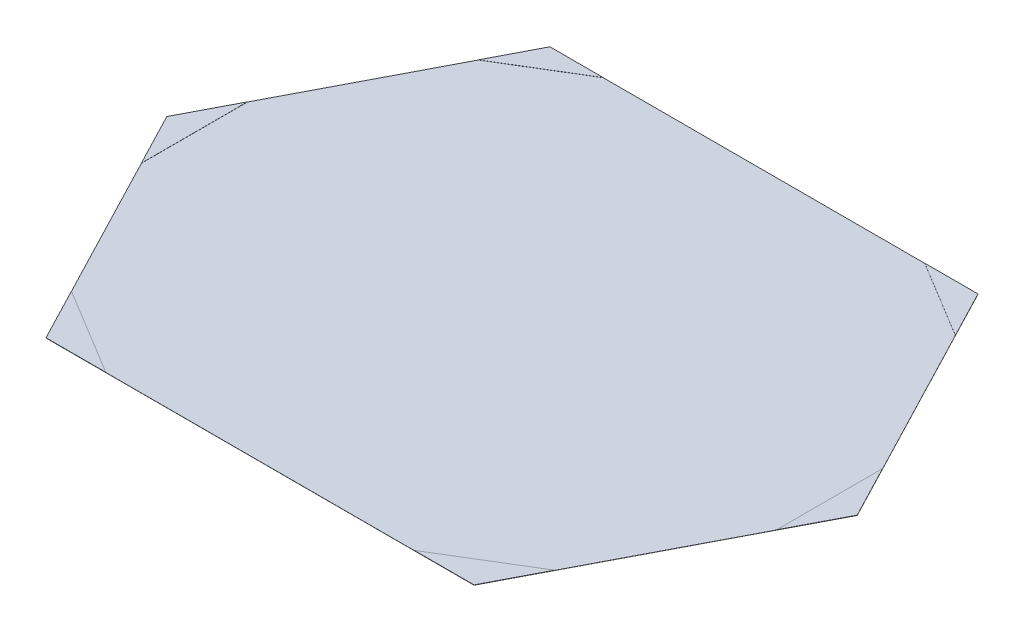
ISO-10303-21;
HEADER;
FILE_DESCRIPTION(('STEP AP214'),'2;1');
FILE_NAME('part.step','',(''),(''),'','','');
FILE_SCHEMA(('AUTOMOTIVE_DESIGN { 1 0 10303 214 1 1 1 1 }'));
ENDSEC;
DATA;
#1=APPLICATION_CONTEXT('core data for automotive mechanical design processes');
#2=APPLICATION_PROTOCOL_DEFINITION('international standard','automotive_design',2000,#1);
#3=PRODUCT_CONTEXT('',#1,'mechanical');
#4=PRODUCT('Part','Part','',(#3));
#5=PRODUCT_RELATED_PRODUCT_CATEGORY('part','',(#4));
#6=PRODUCT_DEFINITION_FORMATION('','',#4);
#7=PRODUCT_DEFINITION_CONTEXT('part definition',#1,'design');
#8=PRODUCT_DEFINITION('design','',#6,#7);
#9=PRODUCT_DEFINITION_SHAPE('','',#8);
#10=(LENGTH_UNIT() NAMED_UNIT(*) SI_UNIT(.MILLI.,.METRE.));
#11=(NAMED_UNIT(*) PLANE_ANGLE_UNIT() SI_UNIT($,.RADIAN.));
#12=(NAMED_UNIT(*) SI_UNIT($,.STERADIAN.) SOLID_ANGLE_UNIT());
#13=UNCERTAINTY_MEASURE_WITH_UNIT(LENGTH_MEASURE(1.E-05),#10,'distance_accuracy_value','');
#14=(GEOMETRIC_REPRESENTATION_CONTEXT(3) GLOBAL_UNCERTAINTY_ASSIGNED_CONTEXT((#13)) GLOBAL_UNIT_ASSIGNED_CONTEXT((#10,
#11,#12)) REPRESENTATION_CONTEXT('',''));
#15=CARTESIAN_POINT('',(0.,0.,0.));
#16=DIRECTION('',(0.,0.,1.));
#17=DIRECTION('',(1.,0.,0.));
#18=AXIS2_PLACEMENT_3D('',#15,#16,#17);
#19=CARTESIAN_POINT('',(0.,1.,0.));
#20=DIRECTION('',(0.,1.,0.));
#21=DIRECTION('',(0.,0.,1.));
#22=AXIS2_PLACEMENT_3D('',#19,#20,#21);
#23=PLANE('',#22);
#24=DIRECTION('',(0.,0.,-1.));
#25=VECTOR('',#24,1.);
#26=CARTESIAN_POINT('',(4800.,1.,384.210526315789));
#27=LINE('',#26,#25);
#28=CARTESIAN_POINT('',(4800.,1.,384.21052631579));
#29=VERTEX_POINT('',#28);
#30=CARTESIAN_POINT('',(4800.,1.,-384.210526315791));
#31=VERTEX_POINT('',#30);
#32=EDGE_CURVE('E172',#29,#31,#27,.T.);
#33=ORIENTED_EDGE('',*,*,#32,.T.);
#34=DIRECTION('',(-0.461735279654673,0.,-0.887017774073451));
#35=VECTOR('',#34,1.);
#36=CARTESIAN_POINT('',(4050.,1.,-1825.));
#37=LINE('',#36,#35);
#38=CARTESIAN_POINT('',(4228.00823517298,1.,-1483.03681137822));
#39=VERTEX_POINT('',#38);
#40=EDGE_CURVE('E59',#31,#39,#37,.T.);
#41=ORIENTED_EDGE('',*,*,#40,.T.);
#42=DIRECTION('',(-0.854907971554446,0.,-0.5187796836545));
#43=VECTOR('',#42,1.);
#44=CARTESIAN_POINT('',(4228.00823517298,1.,-1483.03681137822));
#45=LINE('',#44,#43);
#46=CARTESIAN_POINT('',(3664.47989136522,1.,-1825.));
#47=VERTEX_POINT('',#46);
#48=EDGE_CURVE('E194',#39,#47,#45,.T.);
#49=ORIENTED_EDGE('',*,*,#48,.T.);
#50=DIRECTION('',(-1.,0.,0.));
#51=VECTOR('',#50,1.);
#52=CARTESIAN_POINT('',(950.,1.,-1825.));
#53=LINE('',#52,#51);
#54=CARTESIAN_POINT('',(1335.52010863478,1.,-1825.));
#55=VERTEX_POINT('',#54);
#56=EDGE_CURVE('E169',#47,#55,#53,.T.);
#57=ORIENTED_EDGE('',*,*,#56,.T.);
#58=DIRECTION('',(0.854907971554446,0.,-0.5187796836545));
#59=VECTOR('',#58,1.);
#60=CARTESIAN_POINT('',(771.991764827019,1.,-1483.03681137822));
#61=LINE('',#60,#59);
#62=CARTESIAN_POINT('',(771.991764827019,1.,-1483.03681137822));
#63=VERTEX_POINT('',#62);
#64=EDGE_CURVE('E210',#63,#55,#61,.T.);
#65=ORIENTED_EDGE('',*,*,#64,.F.);
#66=DIRECTION('',(-0.461735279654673,0.,0.887017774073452));
#67=VECTOR('',#66,1.);
#68=CARTESIAN_POINT('',(0.,1.,0.));
#69=LINE('',#68,#67);
#70=CARTESIAN_POINT('',(200.,1.,-384.210526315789));
#71=VERTEX_POINT('',#70);
#72=EDGE_CURVE('E39',#63,#71,#69,.T.);
#73=ORIENTED_EDGE('',*,*,#72,.T.);
#74=DIRECTION('',(0.,0.,1.));
#75=VECTOR('',#74,1.);
#76=CARTESIAN_POINT('',(200.,1.,0.));
#77=LINE('',#76,#75);
#78=CARTESIAN_POINT('',(200.,1.,384.21052631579));
#79=VERTEX_POINT('',#78);
#80=EDGE_CURVE('E247',#71,#79,#77,.T.);
#81=ORIENTED_EDGE('',*,*,#80,.T.);
#82=DIRECTION('',(0.461735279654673,0.,0.887017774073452));
#83=VECTOR('',#82,1.);
#84=CARTESIAN_POINT('',(0.,1.,0.));
#85=LINE('',#84,#83);
#86=CARTESIAN_POINT('',(750.,1.,1440.78947368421));
#87=VERTEX_POINT('',#86);
#88=EDGE_CURVE('E272',#79,#87,#85,.T.);
#89=ORIENTED_EDGE('',*,*,#88,.T.);
#90=DIRECTION('',(0.854907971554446,0.,0.5187796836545));
#91=VECTOR('',#90,1.);
#92=CARTESIAN_POINT('',(-437.153665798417,1.,720.394736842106));
#93=LINE('',#92,#91);
#94=CARTESIAN_POINT('',(1383.14862175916,1.,1825.));
#95=VERTEX_POINT('',#94);
#96=EDGE_CURVE('E227',#87,#95,#93,.T.);
#97=ORIENTED_EDGE('',*,*,#96,.T.);
#98=DIRECTION('',(1.,0.,0.));
#99=VECTOR('',#98,1.);
#100=CARTESIAN_POINT('',(950.,1.,1825.));
#101=LINE('',#100,#99);
#102=CARTESIAN_POINT('',(3616.85137824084,1.,1825.));
#103=VERTEX_POINT('',#102);
#104=EDGE_CURVE('E350',#95,#103,#101,.T.);
#105=ORIENTED_EDGE('',*,*,#104,.T.);
#106=DIRECTION('',(-0.854907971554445,0.,0.518779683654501));
#107=VECTOR('',#106,1.);
#108=CARTESIAN_POINT('',(1782.81546666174,1.,2937.93917202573));
#109=LINE('',#108,#107);
#110=CARTESIAN_POINT('',(4250.,1.,1440.78947368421));
#111=VERTEX_POINT('',#110);
#112=EDGE_CURVE('E244',#111,#103,#109,.T.);
#113=ORIENTED_EDGE('',*,*,#112,.F.);
#114=DIRECTION('',(0.461735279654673,0.,-0.887017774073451));
#115=VECTOR('',#114,1.);
#116=CARTESIAN_POINT('',(4050.,1.,1825.));
#117=LINE('',#116,#115);
#118=EDGE_CURVE('E53',#111,#29,#117,.T.);
#119=ORIENTED_EDGE('',*,*,#118,.T.);
#120=EDGE_LOOP('',(#33,#41,#49,#57,#65,#73,#81,#89,#97,#105,#113,#119));
#121=FACE_BOUND('',#120,.T.);
#122=ADVANCED_FACE('F35',(#121),#23,.T.);
#123=CARTESIAN_POINT('',(0.,1.,0.));
#124=DIRECTION('',(0.887017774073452,0.,-0.461735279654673));
#125=DIRECTION('',(-0.461735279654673,0.,-0.887017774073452));
#126=AXIS2_PLACEMENT_3D('',#123,#124,#125);
#127=PLANE('',#126);
#128=DIRECTION('',(0.461735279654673,0.,0.887017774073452));
#129=VECTOR('',#128,1.);
#130=CARTESIAN_POINT('',(0.,0.,0.));
#131=LINE('',#130,#129);
#132=CARTESIAN_POINT('',(0.,0.,0.));
#133=VERTEX_POINT('',#132);
#134=CARTESIAN_POINT('',(950.,0.,1825.));
#135=VERTEX_POINT('',#134);
#136=EDGE_CURVE('E278',#133,#135,#131,.T.);
#137=ORIENTED_EDGE('',*,*,#136,.T.);
#138=DIRECTION('',(0.,-1.,0.));
#139=VECTOR('',#138,1.);
#140=CARTESIAN_POINT('',(950.,1.,1825.));
#141=LINE('',#140,#139);
#142=CARTESIAN_POINT('',(950.,2.,1825.));
#143=VERTEX_POINT('',#142);
#144=EDGE_CURVE('E11',#143,#135,#141,.T.);
#145=ORIENTED_EDGE('',*,*,#144,.F.);
#146=DIRECTION('',(0.461735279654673,0.,0.887017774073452));
#147=VECTOR('',#146,1.);
#148=CARTESIAN_POINT('',(0.,2.,0.));
#149=LINE('',#148,#147);
#150=CARTESIAN_POINT('',(750.,2.,1440.78947368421));
#151=VERTEX_POINT('',#150);
#152=EDGE_CURVE('E233',#151,#143,#149,.T.);
#153=ORIENTED_EDGE('',*,*,#152,.F.);
#154=DIRECTION('',(0.,-1.,0.));
#155=VECTOR('',#154,1.);
#156=CARTESIAN_POINT('',(750.,2.,1440.78947368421));
#157=LINE('',#156,#155);
#158=EDGE_CURVE('E213',#151,#87,#157,.T.);
#159=ORIENTED_EDGE('',*,*,#158,.T.);
#160=ORIENTED_EDGE('',*,*,#88,.F.);
#161=DIRECTION('',(0.,-1.,0.));
#162=VECTOR('',#161,1.);
#163=CARTESIAN_POINT('',(200.,2.,384.21052631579));
#164=LINE('',#163,#162);
#165=CARTESIAN_POINT('',(200.,2.,384.21052631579));
#166=VERTEX_POINT('',#165);
#167=EDGE_CURVE('E263',#166,#79,#164,.T.);
#168=ORIENTED_EDGE('',*,*,#167,.F.);
#169=DIRECTION('',(0.461735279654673,0.,0.887017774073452));
#170=VECTOR('',#169,1.);
#171=CARTESIAN_POINT('',(0.,2.,0.));
#172=LINE('',#171,#170);
#173=CARTESIAN_POINT('',(0.,2.,0.));
#174=VERTEX_POINT('',#173);
#175=EDGE_CURVE('E261',#174,#166,#172,.T.);
#176=ORIENTED_EDGE('',*,*,#175,.F.);
#177=DIRECTION('',(0.,-1.,0.));
#178=VECTOR('',#177,1.);
#179=CARTESIAN_POINT('',(0.,1.,0.));
#180=LINE('',#179,#178);
#181=EDGE_CURVE('E301',#174,#133,#180,.T.);
#182=ORIENTED_EDGE('',*,*,#181,.T.);
#183=EDGE_LOOP('',(#137,#145,#153,#159,#160,#168,#176,#182));
#184=FACE_BOUND('',#183,.T.);
#185=ADVANCED_FACE('F37',(#184),#127,.F.);
#186=CARTESIAN_POINT('',(950.,1.,1825.));
#187=DIRECTION('',(0.,0.,-1.));
#188=DIRECTION('',(-1.,0.,0.));
#189=AXIS2_PLACEMENT_3D('',#186,#187,#188);
#190=PLANE('',#189);
#191=DIRECTION('',(1.,0.,0.));
#192=VECTOR('',#191,1.);
#193=CARTESIAN_POINT('',(950.,0.,1825.));
#194=LINE('',#193,#192);
#195=CARTESIAN_POINT('',(4050.,0.,1825.));
#196=VERTEX_POINT('',#195);
#197=EDGE_CURVE('E284',#135,#196,#194,.T.);
#198=ORIENTED_EDGE('',*,*,#197,.T.);
#199=DIRECTION('',(0.,-1.,0.));
#200=VECTOR('',#199,1.);
#201=CARTESIAN_POINT('',(4050.,1.,1825.));
#202=LINE('',#201,#200);
#203=CARTESIAN_POINT('',(4050.,2.,1825.));
#204=VERTEX_POINT('',#203);
#205=EDGE_CURVE('E45',#204,#196,#202,.T.);
#206=ORIENTED_EDGE('',*,*,#205,.F.);
#207=DIRECTION('',(1.,0.,0.));
#208=VECTOR('',#207,1.);
#209=CARTESIAN_POINT('',(0.,2.,1825.));
#210=LINE('',#209,#208);
#211=CARTESIAN_POINT('',(3616.85137824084,2.,1825.));
#212=VERTEX_POINT('',#211);
#213=EDGE_CURVE('E243',#212,#204,#210,.T.);
#214=ORIENTED_EDGE('',*,*,#213,.F.);
#215=DIRECTION('',(0.,-1.,0.));
#216=VECTOR('',#215,1.);
#217=CARTESIAN_POINT('',(3616.85137824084,2.,1825.));
#218=LINE('',#217,#216);
#219=EDGE_CURVE('E240',#212,#103,#218,.T.);
#220=ORIENTED_EDGE('',*,*,#219,.T.);
#221=ORIENTED_EDGE('',*,*,#104,.F.);
#222=DIRECTION('',(0.,-1.,0.));
#223=VECTOR('',#222,1.);
#224=CARTESIAN_POINT('',(1383.14862175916,2.,1825.));
#225=LINE('',#224,#223);
#226=CARTESIAN_POINT('',(1383.14862175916,2.,1825.));
#227=VERTEX_POINT('',#226);
#228=EDGE_CURVE('E223',#227,#95,#225,.T.);
#229=ORIENTED_EDGE('',*,*,#228,.F.);
#230=DIRECTION('',(1.,0.,0.));
#231=VECTOR('',#230,1.);
#232=CARTESIAN_POINT('',(0.,2.,1825.));
#233=LINE('',#232,#231);
#234=EDGE_CURVE('E226',#143,#227,#233,.T.);
#235=ORIENTED_EDGE('',*,*,#234,.F.);
#236=ORIENTED_EDGE('',*,*,#144,.T.);
#237=EDGE_LOOP('',(#198,#206,#214,#220,#221,#229,#235,#236));
#238=FACE_BOUND('',#237,.T.);
#239=ADVANCED_FACE('F356',(#238),#190,.F.);
#240=CARTESIAN_POINT('',(4050.,1.,1825.));
#241=DIRECTION('',(-0.887017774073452,0.,-0.461735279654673));
#242=DIRECTION('',(-0.461735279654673,0.,0.887017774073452));
#243=AXIS2_PLACEMENT_3D('',#240,#241,#242);
#244=PLANE('',#243);
#245=DIRECTION('',(0.461735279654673,0.,-0.887017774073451));
#246=VECTOR('',#245,1.);
#247=CARTESIAN_POINT('',(4050.,0.,1825.));
#248=LINE('',#247,#246);
#249=CARTESIAN_POINT('',(5000.,0.,0.));
#250=VERTEX_POINT('',#249);
#251=EDGE_CURVE('E289',#196,#250,#248,.T.);
#252=ORIENTED_EDGE('',*,*,#251,.T.);
#253=DIRECTION('',(0.,-1.,0.));
#254=VECTOR('',#253,1.);
#255=CARTESIAN_POINT('',(5000.,1.,0.));
#256=LINE('',#255,#254);
#257=CARTESIAN_POINT('',(5000.,2.,-1.40491376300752E-12));
#258=VERTEX_POINT('',#257);
#259=EDGE_CURVE('E309',#258,#250,#256,.T.);
#260=ORIENTED_EDGE('',*,*,#259,.F.);
#261=DIRECTION('',(-0.461735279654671,0.,0.887017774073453));
#262=VECTOR('',#261,1.);
#263=CARTESIAN_POINT('',(5000.,2.,-1.40491376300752E-12));
#264=LINE('',#263,#262);
#265=CARTESIAN_POINT('',(4800.,2.,384.210526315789));
#266=VERTEX_POINT('',#265);
#267=EDGE_CURVE('E179',#258,#266,#264,.T.);
#268=ORIENTED_EDGE('',*,*,#267,.T.);
#269=DIRECTION('',(0.,-1.,0.));
#270=VECTOR('',#269,1.);
#271=CARTESIAN_POINT('',(4800.,2.,384.210526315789));
#272=LINE('',#271,#270);
#273=EDGE_CURVE('E180',#266,#29,#272,.T.);
#274=ORIENTED_EDGE('',*,*,#273,.T.);
#275=ORIENTED_EDGE('',*,*,#118,.F.);
#276=DIRECTION('',(0.,-1.,0.));
#277=VECTOR('',#276,1.);
#278=CARTESIAN_POINT('',(4250.,2.,1440.78947368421));
#279=LINE('',#278,#277);
#280=CARTESIAN_POINT('',(4250.,2.,1440.78947368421));
#281=VERTEX_POINT('',#280);
#282=EDGE_CURVE('E230',#281,#111,#279,.T.);
#283=ORIENTED_EDGE('',*,*,#282,.F.);
#284=DIRECTION('',(0.461735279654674,0.,-0.887017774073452));
#285=VECTOR('',#284,1.);
#286=CARTESIAN_POINT('',(3934.0026576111,2.,2047.83699985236));
#287=LINE('',#286,#285);
#288=EDGE_CURVE('E248',#204,#281,#287,.T.);
#289=ORIENTED_EDGE('',*,*,#288,.F.);
#290=ORIENTED_EDGE('',*,*,#205,.T.);
#291=EDGE_LOOP('',(#252,#260,#268,#274,#275,#283,#289,#290));
#292=FACE_BOUND('',#291,.T.);
#293=ADVANCED_FACE('F316',(#292),#244,.F.);
#294=CARTESIAN_POINT('',(4050.,1.,-1825.));
#295=DIRECTION('',(-0.887017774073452,0.,0.461735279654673));
#296=DIRECTION('',(0.461735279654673,0.,0.887017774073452));
#297=AXIS2_PLACEMENT_3D('',#294,#295,#296);
#298=PLANE('',#297);
#299=DIRECTION('',(-0.461735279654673,0.,-0.887017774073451));
#300=VECTOR('',#299,1.);
#301=CARTESIAN_POINT('',(4050.,0.,-1825.));
#302=LINE('',#301,#300);
#303=CARTESIAN_POINT('',(4050.,0.,-1825.));
#304=VERTEX_POINT('',#303);
#305=EDGE_CURVE('E295',#250,#304,#302,.T.);
#306=ORIENTED_EDGE('',*,*,#305,.T.);
#307=DIRECTION('',(0.,-1.,0.));
#308=VECTOR('',#307,1.);
#309=CARTESIAN_POINT('',(4050.,1.,-1825.));
#310=LINE('',#309,#308);
#311=CARTESIAN_POINT('',(4050.,2.,-1825.));
#312=VERTEX_POINT('',#311);
#313=EDGE_CURVE('E306',#312,#304,#310,.T.);
#314=ORIENTED_EDGE('',*,*,#313,.F.);
#315=DIRECTION('',(0.461735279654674,0.,0.887017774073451));
#316=VECTOR('',#315,1.);
#317=CARTESIAN_POINT('',(4050.,2.,-1825.));
#318=LINE('',#317,#316);
#319=CARTESIAN_POINT('',(4228.00823517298,2.,-1483.03681137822));
#320=VERTEX_POINT('',#319);
#321=EDGE_CURVE('E192',#312,#320,#318,.T.);
#322=ORIENTED_EDGE('',*,*,#321,.T.);
#323=DIRECTION('',(0.,-1.,0.));
#324=VECTOR('',#323,1.);
#325=CARTESIAN_POINT('',(4228.00823517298,2.,-1483.03681137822));
#326=LINE('',#325,#324);
#327=EDGE_CURVE('E167',#320,#39,#326,.T.);
#328=ORIENTED_EDGE('',*,*,#327,.T.);
#329=ORIENTED_EDGE('',*,*,#40,.F.);
#330=DIRECTION('',(0.,-1.,0.));
#331=VECTOR('',#330,1.);
#332=CARTESIAN_POINT('',(4800.,2.,-384.210526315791));
#333=LINE('',#332,#331);
#334=CARTESIAN_POINT('',(4800.,2.,-384.210526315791));
#335=VERTEX_POINT('',#334);
#336=EDGE_CURVE('E164',#335,#31,#333,.T.);
#337=ORIENTED_EDGE('',*,*,#336,.F.);
#338=DIRECTION('',(0.461735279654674,0.,0.887017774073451));
#339=VECTOR('',#338,1.);
#340=CARTESIAN_POINT('',(4800.,2.,-384.210526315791));
#341=LINE('',#340,#339);
#342=EDGE_CURVE('E183',#335,#258,#341,.T.);
#343=ORIENTED_EDGE('',*,*,#342,.T.);
#344=ORIENTED_EDGE('',*,*,#259,.T.);
#345=EDGE_LOOP('',(#306,#314,#322,#328,#329,#337,#343,#344));
#346=FACE_BOUND('',#345,.T.);
#347=ADVANCED_FACE('F161',(#346),#298,.F.);
#348=CARTESIAN_POINT('',(950.,1.,-1825.));
#349=DIRECTION('',(0.,0.,1.));
#350=DIRECTION('',(1.,0.,0.));
#351=AXIS2_PLACEMENT_3D('',#348,#349,#350);
#352=PLANE('',#351);
#353=DIRECTION('',(-1.,0.,0.));
#354=VECTOR('',#353,1.);
#355=CARTESIAN_POINT('',(950.,0.,-1825.));
#356=LINE('',#355,#354);
#357=CARTESIAN_POINT('',(950.,0.,-1825.));
#358=VERTEX_POINT('',#357);
#359=EDGE_CURVE('E297',#304,#358,#356,.T.);
#360=ORIENTED_EDGE('',*,*,#359,.T.);
#361=DIRECTION('',(0.,-1.,0.));
#362=VECTOR('',#361,1.);
#363=CARTESIAN_POINT('',(950.,1.,-1825.));
#364=LINE('',#363,#362);
#365=CARTESIAN_POINT('',(950.,2.,-1825.));
#366=VERTEX_POINT('',#365);
#367=EDGE_CURVE('E303',#366,#358,#364,.T.);
#368=ORIENTED_EDGE('',*,*,#367,.F.);
#369=DIRECTION('',(-1.,0.,0.));
#370=VECTOR('',#369,1.);
#371=CARTESIAN_POINT('',(1335.52010863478,2.,-1825.));
#372=LINE('',#371,#370);
#373=CARTESIAN_POINT('',(1335.52010863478,2.,-1825.));
#374=VERTEX_POINT('',#373);
#375=EDGE_CURVE('E209',#374,#366,#372,.T.);
#376=ORIENTED_EDGE('',*,*,#375,.F.);
#377=DIRECTION('',(0.,-1.,0.));
#378=VECTOR('',#377,1.);
#379=CARTESIAN_POINT('',(1335.52010863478,2.,-1825.));
#380=LINE('',#379,#378);
#381=EDGE_CURVE('E206',#374,#55,#380,.T.);
#382=ORIENTED_EDGE('',*,*,#381,.T.);
#383=ORIENTED_EDGE('',*,*,#56,.F.);
#384=DIRECTION('',(0.,-1.,0.));
#385=VECTOR('',#384,1.);
#386=CARTESIAN_POINT('',(3664.47989136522,2.,-1825.));
#387=LINE('',#386,#385);
#388=CARTESIAN_POINT('',(3664.47989136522,2.,-1825.));
#389=VERTEX_POINT('',#388);
#390=EDGE_CURVE('E189',#389,#47,#387,.T.);
#391=ORIENTED_EDGE('',*,*,#390,.F.);
#392=DIRECTION('',(1.,0.,0.));
#393=VECTOR('',#392,1.);
#394=CARTESIAN_POINT('',(3664.47989136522,2.,-1825.));
#395=LINE('',#394,#393);
#396=EDGE_CURVE('E199',#389,#312,#395,.T.);
#397=ORIENTED_EDGE('',*,*,#396,.T.);
#398=ORIENTED_EDGE('',*,*,#313,.T.);
#399=EDGE_LOOP('',(#360,#368,#376,#382,#383,#391,#397,#398));
#400=FACE_BOUND('',#399,.T.);
#401=ADVANCED_FACE('F326',(#400),#352,.F.);
#402=CARTESIAN_POINT('',(0.,1.,0.));
#403=DIRECTION('',(0.887017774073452,0.,0.461735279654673));
#404=DIRECTION('',(0.461735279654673,0.,-0.887017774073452));
#405=AXIS2_PLACEMENT_3D('',#402,#403,#404);
#406=PLANE('',#405);
#407=DIRECTION('',(-0.461735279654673,0.,0.887017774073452));
#408=VECTOR('',#407,1.);
#409=CARTESIAN_POINT('',(0.,0.,0.));
#410=LINE('',#409,#408);
#411=EDGE_CURVE('E299',#358,#133,#410,.T.);
#412=ORIENTED_EDGE('',*,*,#411,.T.);
#413=ORIENTED_EDGE('',*,*,#181,.F.);
#414=DIRECTION('',(-0.461735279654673,0.,0.887017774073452));
#415=VECTOR('',#414,1.);
#416=CARTESIAN_POINT('',(0.,2.,0.));
#417=LINE('',#416,#415);
#418=CARTESIAN_POINT('',(200.,2.,-384.210526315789));
#419=VERTEX_POINT('',#418);
#420=EDGE_CURVE('E258',#419,#174,#417,.T.);
#421=ORIENTED_EDGE('',*,*,#420,.F.);
#422=DIRECTION('',(0.,-1.,0.));
#423=VECTOR('',#422,1.);
#424=CARTESIAN_POINT('',(200.,2.,-384.210526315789));
#425=LINE('',#424,#423);
#426=EDGE_CURVE('E274',#419,#71,#425,.T.);
#427=ORIENTED_EDGE('',*,*,#426,.T.);
#428=ORIENTED_EDGE('',*,*,#72,.F.);
#429=DIRECTION('',(0.,-1.,0.));
#430=VECTOR('',#429,1.);
#431=CARTESIAN_POINT('',(771.991764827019,2.,-1483.03681137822));
#432=LINE('',#431,#430);
#433=CARTESIAN_POINT('',(771.991764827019,2.,-1483.03681137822));
#434=VERTEX_POINT('',#433);
#435=EDGE_CURVE('E196',#434,#63,#432,.T.);
#436=ORIENTED_EDGE('',*,*,#435,.F.);
#437=DIRECTION('',(-0.461735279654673,0.,0.887017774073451));
#438=VECTOR('',#437,1.);
#439=CARTESIAN_POINT('',(950.,2.,-1825.));
#440=LINE('',#439,#438);
#441=EDGE_CURVE('E214',#366,#434,#440,.T.);
#442=ORIENTED_EDGE('',*,*,#441,.F.);
#443=ORIENTED_EDGE('',*,*,#367,.T.);
#444=EDGE_LOOP('',(#412,#413,#421,#427,#428,#436,#442,#443));
#445=FACE_BOUND('',#444,.T.);
#446=ADVANCED_FACE('F343',(#445),#406,.F.);
#447=CARTESIAN_POINT('',(0.,0.,0.));
#448=DIRECTION('',(0.,1.,0.));
#449=DIRECTION('',(0.,0.,1.));
#450=AXIS2_PLACEMENT_3D('',#447,#448,#449);
#451=PLANE('',#450);
#452=ORIENTED_EDGE('',*,*,#136,.F.);
#453=ORIENTED_EDGE('',*,*,#411,.F.);
#454=ORIENTED_EDGE('',*,*,#359,.F.);
#455=ORIENTED_EDGE('',*,*,#305,.F.);
#456=ORIENTED_EDGE('',*,*,#251,.F.);
#457=ORIENTED_EDGE('',*,*,#197,.F.);
#458=EDGE_LOOP('',(#452,#453,#454,#455,#456,#457));
#459=FACE_BOUND('',#458,.T.);
#460=ADVANCED_FACE('F322',(#459),#451,.F.);
#461=CARTESIAN_POINT('',(200.,2.,0.));
#462=DIRECTION('',(1.,0.,0.));
#463=DIRECTION('',(0.,0.,-1.));
#464=AXIS2_PLACEMENT_3D('',#461,#462,#463);
#465=PLANE('',#464);
#466=ORIENTED_EDGE('',*,*,#80,.F.);
#467=ORIENTED_EDGE('',*,*,#426,.F.);
#468=DIRECTION('',(0.,0.,1.));
#469=VECTOR('',#468,1.);
#470=CARTESIAN_POINT('',(200.,2.,0.));
#471=LINE('',#470,#469);
#472=EDGE_CURVE('E255',#419,#166,#471,.T.);
#473=ORIENTED_EDGE('',*,*,#472,.T.);
#474=ORIENTED_EDGE('',*,*,#167,.T.);
#475=EDGE_LOOP('',(#466,#467,#473,#474));
#476=FACE_BOUND('',#475,.T.);
#477=ADVANCED_FACE('F376',(#476),#465,.T.);
#478=CARTESIAN_POINT('',(0.,2.,0.));
#479=DIRECTION('',(0.,1.,0.));
#480=DIRECTION('',(0.,0.,1.));
#481=AXIS2_PLACEMENT_3D('',#478,#479,#480);
#482=PLANE('',#481);
#483=ORIENTED_EDGE('',*,*,#472,.F.);
#484=ORIENTED_EDGE('',*,*,#420,.T.);
#485=ORIENTED_EDGE('',*,*,#175,.T.);
#486=EDGE_LOOP('',(#483,#484,#485));
#487=FACE_BOUND('',#486,.T.);
#488=ADVANCED_FACE('F418',(#487),#482,.T.);
#489=CARTESIAN_POINT('',(1782.81546666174,2.,2937.93917202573));
#490=DIRECTION('',(0.518779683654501,0.,0.854907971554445));
#491=DIRECTION('',(0.854907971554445,0.,-0.518779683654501));
#492=AXIS2_PLACEMENT_3D('',#489,#490,#491);
#493=PLANE('',#492);
#494=ORIENTED_EDGE('',*,*,#112,.T.);
#495=ORIENTED_EDGE('',*,*,#219,.F.);
#496=DIRECTION('',(-0.854907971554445,0.,0.518779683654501));
#497=VECTOR('',#496,1.);
#498=CARTESIAN_POINT('',(1782.81546666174,2.,2937.93917202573));
#499=LINE('',#498,#497);
#500=EDGE_CURVE('E251',#281,#212,#499,.T.);
#501=ORIENTED_EDGE('',*,*,#500,.F.);
#502=ORIENTED_EDGE('',*,*,#282,.T.);
#503=EDGE_LOOP('',(#494,#495,#501,#502));
#504=FACE_BOUND('',#503,.T.);
#505=ADVANCED_FACE('F355',(#504),#493,.F.);
#506=CARTESIAN_POINT('',(0.,2.,0.));
#507=DIRECTION('',(0.,1.,0.));
#508=DIRECTION('',(0.,0.,1.));
#509=AXIS2_PLACEMENT_3D('',#506,#507,#508);
#510=PLANE('',#509);
#511=ORIENTED_EDGE('',*,*,#288,.T.);
#512=ORIENTED_EDGE('',*,*,#500,.T.);
#513=ORIENTED_EDGE('',*,*,#213,.T.);
#514=EDGE_LOOP('',(#511,#512,#513));
#515=FACE_BOUND('',#514,.T.);
#516=ADVANCED_FACE('F358',(#515),#510,.T.);
#517=CARTESIAN_POINT('',(-437.153665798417,2.,720.394736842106));
#518=DIRECTION('',(0.5187796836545,0.,-0.854907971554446));
#519=DIRECTION('',(-0.854907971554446,0.,-0.5187796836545));
#520=AXIS2_PLACEMENT_3D('',#517,#518,#519);
#521=PLANE('',#520);
#522=ORIENTED_EDGE('',*,*,#96,.F.);
#523=ORIENTED_EDGE('',*,*,#158,.F.);
#524=DIRECTION('',(0.854907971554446,0.,0.5187796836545));
#525=VECTOR('',#524,1.);
#526=CARTESIAN_POINT('',(-437.153665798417,2.,720.394736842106));
#527=LINE('',#526,#525);
#528=EDGE_CURVE('E231',#151,#227,#527,.T.);
#529=ORIENTED_EDGE('',*,*,#528,.T.);
#530=ORIENTED_EDGE('',*,*,#228,.T.);
#531=EDGE_LOOP('',(#522,#523,#529,#530));
#532=FACE_BOUND('',#531,.T.);
#533=ADVANCED_FACE('F436',(#532),#521,.T.);
#534=CARTESIAN_POINT('',(0.,2.,0.));
#535=DIRECTION('',(0.,1.,0.));
#536=DIRECTION('',(0.,0.,1.));
#537=AXIS2_PLACEMENT_3D('',#534,#535,#536);
#538=PLANE('',#537);
#539=ORIENTED_EDGE('',*,*,#528,.F.);
#540=ORIENTED_EDGE('',*,*,#152,.T.);
#541=ORIENTED_EDGE('',*,*,#234,.T.);
#542=EDGE_LOOP('',(#539,#540,#541));
#543=FACE_BOUND('',#542,.T.);
#544=ADVANCED_FACE('F443',(#543),#538,.T.);
#545=CARTESIAN_POINT('',(771.991764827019,2.,-1483.03681137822));
#546=DIRECTION('',(-0.5187796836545,0.,-0.854907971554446));
#547=DIRECTION('',(-0.854907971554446,0.,0.5187796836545));
#548=AXIS2_PLACEMENT_3D('',#545,#546,#547);
#549=PLANE('',#548);
#550=ORIENTED_EDGE('',*,*,#64,.T.);
#551=ORIENTED_EDGE('',*,*,#381,.F.);
#552=DIRECTION('',(0.854907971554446,0.,-0.5187796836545));
#553=VECTOR('',#552,1.);
#554=CARTESIAN_POINT('',(771.991764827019,2.,-1483.03681137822));
#555=LINE('',#554,#553);
#556=EDGE_CURVE('E217',#434,#374,#555,.T.);
#557=ORIENTED_EDGE('',*,*,#556,.F.);
#558=ORIENTED_EDGE('',*,*,#435,.T.);
#559=EDGE_LOOP('',(#550,#551,#557,#558));
#560=FACE_BOUND('',#559,.T.);
#561=ADVANCED_FACE('F337',(#560),#549,.F.);
#562=CARTESIAN_POINT('',(0.,2.,0.));
#563=DIRECTION('',(0.,-1.,0.));
#564=DIRECTION('',(0.,0.,-1.));
#565=AXIS2_PLACEMENT_3D('',#562,#563,#564);
#566=PLANE('',#565);
#567=ORIENTED_EDGE('',*,*,#441,.T.);
#568=ORIENTED_EDGE('',*,*,#556,.T.);
#569=ORIENTED_EDGE('',*,*,#375,.T.);
#570=EDGE_LOOP('',(#567,#568,#569));
#571=FACE_BOUND('',#570,.T.);
#572=ADVANCED_FACE('F342',(#571),#566,.F.);
#573=CARTESIAN_POINT('',(4228.00823517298,2.,-1483.03681137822));
#574=DIRECTION('',(-0.5187796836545,0.,0.854907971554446));
#575=DIRECTION('',(0.854907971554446,0.,0.5187796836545));
#576=AXIS2_PLACEMENT_3D('',#573,#574,#575);
#577=PLANE('',#576);
#578=ORIENTED_EDGE('',*,*,#48,.F.);
#579=ORIENTED_EDGE('',*,*,#327,.F.);
#580=DIRECTION('',(-0.854907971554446,0.,-0.5187796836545));
#581=VECTOR('',#580,1.);
#582=CARTESIAN_POINT('',(4228.00823517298,2.,-1483.03681137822));
#583=LINE('',#582,#581);
#584=EDGE_CURVE('E197',#320,#389,#583,.T.);
#585=ORIENTED_EDGE('',*,*,#584,.T.);
#586=ORIENTED_EDGE('',*,*,#390,.T.);
#587=EDGE_LOOP('',(#578,#579,#585,#586));
#588=FACE_BOUND('',#587,.T.);
#589=ADVANCED_FACE('F333',(#588),#577,.T.);
#590=CARTESIAN_POINT('',(0.,2.,0.));
#591=DIRECTION('',(0.,-1.,0.));
#592=DIRECTION('',(0.,0.,-1.));
#593=AXIS2_PLACEMENT_3D('',#590,#591,#592);
#594=PLANE('',#593);
#595=ORIENTED_EDGE('',*,*,#584,.F.);
#596=ORIENTED_EDGE('',*,*,#321,.F.);
#597=ORIENTED_EDGE('',*,*,#396,.F.);
#598=EDGE_LOOP('',(#595,#596,#597));
#599=FACE_BOUND('',#598,.T.);
#600=ADVANCED_FACE('F331',(#599),#594,.F.);
#601=CARTESIAN_POINT('',(4800.,2.,384.210526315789));
#602=DIRECTION('',(-1.,0.,0.));
#603=DIRECTION('',(0.,0.,1.));
#604=AXIS2_PLACEMENT_3D('',#601,#602,#603);
#605=PLANE('',#604);
#606=ORIENTED_EDGE('',*,*,#32,.F.);
#607=ORIENTED_EDGE('',*,*,#273,.F.);
#608=DIRECTION('',(0.,0.,-1.));
#609=VECTOR('',#608,1.);
#610=CARTESIAN_POINT('',(4800.,2.,384.210526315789));
#611=LINE('',#610,#609);
#612=EDGE_CURVE('E174',#266,#335,#611,.T.);
#613=ORIENTED_EDGE('',*,*,#612,.T.);
#614=ORIENTED_EDGE('',*,*,#336,.T.);
#615=EDGE_LOOP('',(#606,#607,#613,#614));
#616=FACE_BOUND('',#615,.T.);
#617=ADVANCED_FACE('F177',(#616),#605,.T.);
#618=CARTESIAN_POINT('',(0.,2.,0.));
#619=DIRECTION('',(0.,-1.,0.));
#620=DIRECTION('',(0.,0.,-1.));
#621=AXIS2_PLACEMENT_3D('',#618,#619,#620);
#622=PLANE('',#621);
#623=ORIENTED_EDGE('',*,*,#612,.F.);
#624=ORIENTED_EDGE('',*,*,#267,.F.);
#625=ORIENTED_EDGE('',*,*,#342,.F.);
#626=EDGE_LOOP('',(#623,#624,#625));
#627=FACE_BOUND('',#626,.T.);
#628=ADVANCED_FACE('F361',(#627),#622,.F.);
#629=CLOSED_SHELL('',(#122,#185,#239,#293,#347,#401,#446,#460,#477,#488,#505,#516,#533,#544,
#561,#572,#589,#600,#617,#628));
#630=MANIFOLD_SOLID_BREP('B2',#629);
#631=ADVANCED_BREP_SHAPE_REPRESENTATION('',(#18,#630),#14);
#632=SHAPE_DEFINITION_REPRESENTATION(#9,#631);
ENDSEC;
END-ISO-10303-21;
